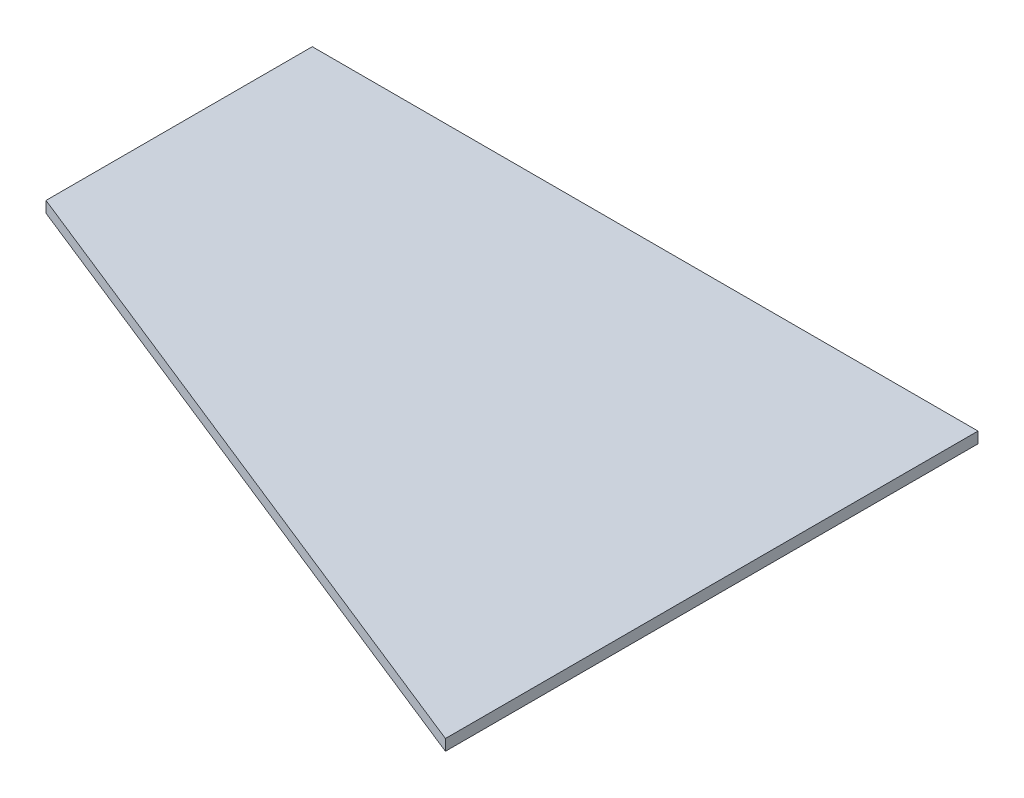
from build123d import *


with BuildPart() as part:
    # Sketch1 → Tapered_plywood_panel section 0
    with BuildSketch(Plane.YZ):
        with BuildLine():
            Line((-82.55, -76.2), (-76.2, -76.2))
            Line((-76.2, -76.2), (-76.2, 76.2))
            Line((-76.2, 76.2), (-82.55, 76.2))
            Line((-82.55, 76.2), (-82.55, -76.2))
        make_face()
    # Sketch2 → Tapered_plywood_panel section 1
    with BuildSketch(Plane.YZ.offset(304.8)):
        with BuildLine():
            Line((-158.75, -152.4), (-152.4, -152.4))
            Line((-152.4, -152.4), (-152.4, 152.4))
            Line((-152.4, 152.4), (-158.75, 152.4))
            Line((-158.75, 152.4), (-158.75, -152.4))
        make_face()
    loft()


solid = part.part
